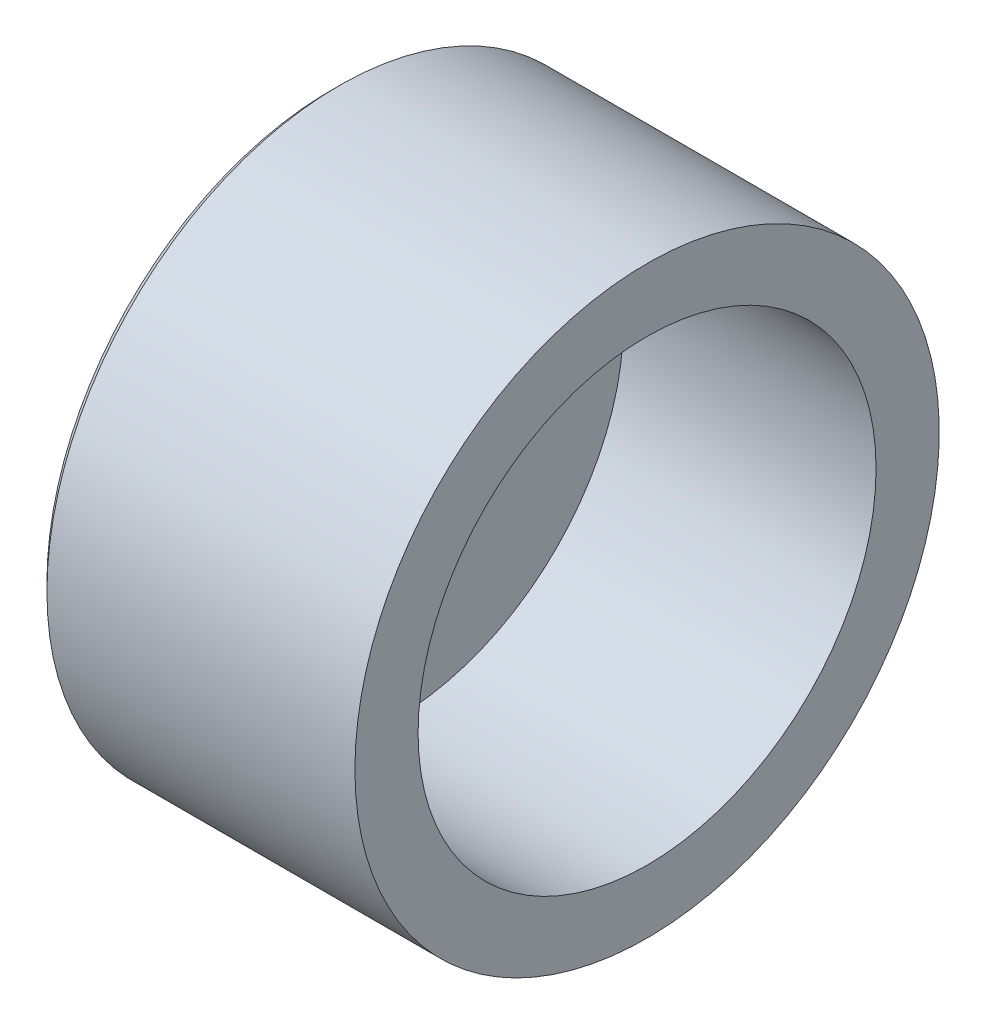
ISO-10303-21;
HEADER;
FILE_DESCRIPTION(('STEP AP214'),'2;1');
FILE_NAME('part.step','',(''),(''),'','','');
FILE_SCHEMA(('AUTOMOTIVE_DESIGN { 1 0 10303 214 1 1 1 1 }'));
ENDSEC;
DATA;
#1=APPLICATION_CONTEXT('core data for automotive mechanical design processes');
#2=APPLICATION_PROTOCOL_DEFINITION('international standard','automotive_design',2000,#1);
#3=PRODUCT_CONTEXT('',#1,'mechanical');
#4=PRODUCT('Part','Part','',(#3));
#5=PRODUCT_RELATED_PRODUCT_CATEGORY('part','',(#4));
#6=PRODUCT_DEFINITION_FORMATION('','',#4);
#7=PRODUCT_DEFINITION_CONTEXT('part definition',#1,'design');
#8=PRODUCT_DEFINITION('design','',#6,#7);
#9=PRODUCT_DEFINITION_SHAPE('','',#8);
#10=(LENGTH_UNIT() NAMED_UNIT(*) SI_UNIT(.MILLI.,.METRE.));
#11=(NAMED_UNIT(*) PLANE_ANGLE_UNIT() SI_UNIT($,.RADIAN.));
#12=(NAMED_UNIT(*) SI_UNIT($,.STERADIAN.) SOLID_ANGLE_UNIT());
#13=UNCERTAINTY_MEASURE_WITH_UNIT(LENGTH_MEASURE(1.E-05),#10,'distance_accuracy_value','');
#14=(GEOMETRIC_REPRESENTATION_CONTEXT(3) GLOBAL_UNCERTAINTY_ASSIGNED_CONTEXT((#13)) GLOBAL_UNIT_ASSIGNED_CONTEXT((#10,
#11,#12)) REPRESENTATION_CONTEXT('',''));
#15=CARTESIAN_POINT('',(0.,0.,0.));
#16=DIRECTION('',(0.,0.,1.));
#17=DIRECTION('',(1.,0.,0.));
#18=AXIS2_PLACEMENT_3D('',#15,#16,#17);
#19=CARTESIAN_POINT('',(2.22044604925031E-13,0.,-8.88178419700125E-13));
#20=DIRECTION('',(-0.999999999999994,0.,0.));
#21=DIRECTION('',(0.,0.,1.));
#22=AXIS2_PLACEMENT_3D('',#19,#20,#21);
#23=CYLINDRICAL_SURFACE('',#22,5.25);
#24=CARTESIAN_POINT('',(3.99999999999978,0.,-6.66133814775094E-13));
#25=DIRECTION('',(-0.999999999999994,0.,0.));
#26=DIRECTION('',(0.,0.,1.));
#27=AXIS2_PLACEMENT_3D('',#24,#25,#26);
#28=CIRCLE('',#27,5.25);
#29=CARTESIAN_POINT('',(3.99999999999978,0.,5.24999999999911));
#30=VERTEX_POINT('',#29);
#31=EDGE_CURVE('E10',#30,#30,#28,.T.);
#32=CARTESIAN_POINT('',(2.22044604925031E-13,0.,-8.88178419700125E-13));
#33=DIRECTION('',(-0.999999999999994,0.,0.));
#34=DIRECTION('',(0.,0.,1.));
#35=AXIS2_PLACEMENT_3D('',#32,#33,#34);
#36=CIRCLE('',#35,5.25);
#37=CARTESIAN_POINT('',(2.24667506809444E-13,0.,5.24999999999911));
#38=VERTEX_POINT('',#37);
#39=EDGE_CURVE('E59',#38,#38,#36,.T.);
#40=CARTESIAN_POINT('',(3.99999999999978,0.,5.24999999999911));
#41=CARTESIAN_POINT('',(3.95833333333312,0.,5.24999999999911));
#42=CARTESIAN_POINT('',(3.91666666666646,0.,5.24999999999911));
#43=CARTESIAN_POINT('',(3.83333333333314,0.,5.24999999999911));
#44=CARTESIAN_POINT('',(3.79166666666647,0.,5.24999999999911));
#45=CARTESIAN_POINT('',(3.70833333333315,0.,5.24999999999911));
#46=CARTESIAN_POINT('',(3.66666666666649,0.,5.24999999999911));
#47=CARTESIAN_POINT('',(3.58333333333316,0.,5.24999999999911));
#48=CARTESIAN_POINT('',(3.5416666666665,0.,5.24999999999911));
#49=CARTESIAN_POINT('',(3.45833333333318,0.,5.24999999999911));
#50=CARTESIAN_POINT('',(3.41666666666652,0.,5.24999999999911));
#51=CARTESIAN_POINT('',(3.33333333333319,0.,5.24999999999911));
#52=CARTESIAN_POINT('',(3.29166666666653,0.,5.24999999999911));
#53=CARTESIAN_POINT('',(3.20833333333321,0.,5.24999999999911));
#54=CARTESIAN_POINT('',(3.16666666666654,0.,5.24999999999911));
#55=CARTESIAN_POINT('',(3.08333333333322,0.,5.24999999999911));
#56=CARTESIAN_POINT('',(3.04166666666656,0.,5.24999999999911));
#57=CARTESIAN_POINT('',(2.95833333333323,0.,5.24999999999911));
#58=CARTESIAN_POINT('',(2.91666666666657,0.,5.24999999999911));
#59=CARTESIAN_POINT('',(2.83333333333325,0.,5.24999999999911));
#60=CARTESIAN_POINT('',(2.79166666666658,0.,5.24999999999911));
#61=CARTESIAN_POINT('',(2.70833333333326,0.,5.24999999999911));
#62=CARTESIAN_POINT('',(2.6666666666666,0.,5.24999999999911));
#63=CARTESIAN_POINT('',(2.58333333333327,0.,5.24999999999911));
#64=CARTESIAN_POINT('',(2.54166666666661,0.,5.24999999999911));
#65=CARTESIAN_POINT('',(2.45833333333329,0.,5.24999999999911));
#66=CARTESIAN_POINT('',(2.41666666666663,0.,5.24999999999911));
#67=CARTESIAN_POINT('',(2.3333333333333,0.,5.24999999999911));
#68=CARTESIAN_POINT('',(2.29166666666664,0.,5.24999999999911));
#69=CARTESIAN_POINT('',(2.20833333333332,0.,5.24999999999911));
#70=CARTESIAN_POINT('',(2.16666666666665,0.,5.24999999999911));
#71=CARTESIAN_POINT('',(2.08333333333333,0.,5.24999999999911));
#72=CARTESIAN_POINT('',(2.04166666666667,0.,5.24999999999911));
#73=CARTESIAN_POINT('',(1.95833333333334,0.,5.24999999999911));
#74=CARTESIAN_POINT('',(1.91666666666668,0.,5.24999999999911));
#75=CARTESIAN_POINT('',(1.83333333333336,0.,5.24999999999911));
#76=CARTESIAN_POINT('',(1.79166666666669,0.,5.24999999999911));
#77=CARTESIAN_POINT('',(1.70833333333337,0.,5.24999999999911));
#78=CARTESIAN_POINT('',(1.66666666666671,0.,5.24999999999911));
#79=CARTESIAN_POINT('',(1.58333333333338,0.,5.24999999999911));
#80=CARTESIAN_POINT('',(1.54166666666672,0.,5.24999999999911));
#81=CARTESIAN_POINT('',(1.4583333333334,0.,5.24999999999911));
#82=CARTESIAN_POINT('',(1.41666666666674,0.,5.24999999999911));
#83=CARTESIAN_POINT('',(1.33333333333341,0.,5.24999999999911));
#84=CARTESIAN_POINT('',(1.29166666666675,0.,5.24999999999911));
#85=CARTESIAN_POINT('',(1.20833333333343,0.,5.24999999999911));
#86=CARTESIAN_POINT('',(1.16666666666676,0.,5.24999999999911));
#87=CARTESIAN_POINT('',(1.08333333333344,0.,5.24999999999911));
#88=CARTESIAN_POINT('',(1.04166666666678,0.,5.24999999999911));
#89=CARTESIAN_POINT('',(0.958333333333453,0.,5.24999999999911));
#90=CARTESIAN_POINT('',(0.916666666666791,0.,5.24999999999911));
#91=CARTESIAN_POINT('',(0.833333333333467,0.,5.24999999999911));
#92=CARTESIAN_POINT('',(0.791666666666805,0.,5.24999999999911));
#93=CARTESIAN_POINT('',(0.70833333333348,0.,5.24999999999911));
#94=CARTESIAN_POINT('',(0.666666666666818,0.,5.24999999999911));
#95=CARTESIAN_POINT('',(0.583333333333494,0.,5.24999999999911));
#96=CARTESIAN_POINT('',(0.541666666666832,0.,5.24999999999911));
#97=CARTESIAN_POINT('',(0.458333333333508,0.,5.24999999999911));
#98=CARTESIAN_POINT('',(0.416666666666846,0.,5.24999999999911));
#99=CARTESIAN_POINT('',(0.333333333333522,0.,5.24999999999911));
#100=CARTESIAN_POINT('',(0.29166666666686,0.,5.24999999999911));
#101=CARTESIAN_POINT('',(0.208333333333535,0.,5.24999999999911));
#102=CARTESIAN_POINT('',(0.166666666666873,0.,5.24999999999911));
#103=CARTESIAN_POINT('',(0.0833333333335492,0.,5.24999999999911));
#104=CARTESIAN_POINT('',(0.041666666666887,0.,5.24999999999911));
#105=CARTESIAN_POINT('',(2.24952001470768E-13,0.,5.24999999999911));
#106=B_SPLINE_CURVE_WITH_KNOTS('',3,(#40,#41,#42,#43,#44,#45,#46,#47,#48,#49,#50,#51,#52,#53,
#54,#55,#56,#57,#58,#59,#60,#61,#62,#63,#64,#65,#66,#67,#68,#69,#70,#71,#72,#73,#74,#75,#76,#77,
#78,#79,#80,#81,#82,#83,#84,#85,#86,#87,#88,#89,#90,#91,#92,#93,#94,#95,#96,#97,#98,#99,#100,
#101,#102,#103,#104,#105),.UNSPECIFIED.,.F.,.F.,(4,2,2,2,2,2,2,2,2,2,2,2,2,2,2,2,2,2,2,2,2,2,2,
2,2,2,2,2,2,2,2,2,4),(0.,0.124999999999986,0.249999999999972,0.374999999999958,
0.499999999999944,0.62499999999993,0.749999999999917,0.874999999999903,0.999999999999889,
1.12499999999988,1.24999999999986,1.37499999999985,1.49999999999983,1.62499999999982,
1.74999999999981,1.87499999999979,1.99999999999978,2.12499999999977,2.24999999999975,
2.37499999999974,2.49999999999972,2.62499999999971,2.7499999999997,2.87499999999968,
2.99999999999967,3.12499999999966,3.24999999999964,3.37499999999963,3.49999999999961,
3.6249999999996,3.74999999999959,3.87499999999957,3.99999999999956),.UNSPECIFIED.);
#107=EDGE_CURVE('BSEAM30',#30,#38,#106,.T.);
#108=ORIENTED_EDGE('',*,*,#31,.F.);
#109=ORIENTED_EDGE('',*,*,#39,.T.);
#110=ORIENTED_EDGE('',*,*,#107,.T.);
#111=ORIENTED_EDGE('',*,*,#107,.F.);
#112=EDGE_LOOP('',(#108,#110,#109,#111));
#113=FACE_BOUND('',#112,.T.);
#114=ADVANCED_FACE('F30',(#113),#23,.F.);
#115=CARTESIAN_POINT('',(3.99999999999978,14.5000000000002,-1.33226762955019E-12));
#116=DIRECTION('',(-0.999999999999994,0.,0.));
#117=DIRECTION('',(0.,0.,1.));
#118=AXIS2_PLACEMENT_3D('',#115,#116,#117);
#119=PLANE('',#118);
#120=CARTESIAN_POINT('',(3.99999999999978,0.,-6.66133814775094E-13));
#121=DIRECTION('',(-0.999999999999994,0.,0.));
#122=DIRECTION('',(0.,0.,1.));
#123=AXIS2_PLACEMENT_3D('',#120,#121,#122);
#124=CIRCLE('',#123,14.5);
#125=CARTESIAN_POINT('',(3.99999999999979,0.,14.4999999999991));
#126=VERTEX_POINT('',#125);
#127=EDGE_CURVE('E37',#126,#126,#124,.T.);
#128=ORIENTED_EDGE('',*,*,#127,.F.);
#129=EDGE_LOOP('',(#128));
#130=FACE_BOUND('',#129,.T.);
#131=ORIENTED_EDGE('',*,*,#31,.T.);
#132=EDGE_LOOP('',(#131));
#133=FACE_BOUND('',#132,.T.);
#134=ADVANCED_FACE('F90',(#130,#133),#119,.F.);
#135=CARTESIAN_POINT('',(2.22044604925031E-13,0.,-8.88178419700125E-13));
#136=DIRECTION('',(-0.999999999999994,0.,0.));
#137=DIRECTION('',(0.,0.,1.));
#138=AXIS2_PLACEMENT_3D('',#135,#136,#137);
#139=CYLINDRICAL_SURFACE('',#138,14.5);
#140=CARTESIAN_POINT('',(20.,0.,-2.22044604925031E-13));
#141=DIRECTION('',(-0.999999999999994,0.,0.));
#142=DIRECTION('',(0.,0.,1.));
#143=AXIS2_PLACEMENT_3D('',#140,#141,#142);
#144=CIRCLE('',#143,14.5);
#145=CARTESIAN_POINT('',(20.,0.,14.4999999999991));
#146=VERTEX_POINT('',#145);
#147=EDGE_CURVE('E44',#146,#146,#144,.T.);
#148=CARTESIAN_POINT('',(20.,0.,14.4999999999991));
#149=CARTESIAN_POINT('',(19.8333333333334,0.,14.4999999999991));
#150=CARTESIAN_POINT('',(19.6666666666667,0.,14.4999999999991));
#151=CARTESIAN_POINT('',(19.3333333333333,0.,14.4999999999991));
#152=CARTESIAN_POINT('',(19.1666666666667,0.,14.4999999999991));
#153=CARTESIAN_POINT('',(18.8333333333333,0.,14.4999999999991));
#154=CARTESIAN_POINT('',(18.6666666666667,0.,14.4999999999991));
#155=CARTESIAN_POINT('',(18.3333333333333,0.,14.4999999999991));
#156=CARTESIAN_POINT('',(18.1666666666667,0.,14.4999999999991));
#157=CARTESIAN_POINT('',(17.8333333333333,0.,14.4999999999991));
#158=CARTESIAN_POINT('',(17.6666666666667,0.,14.4999999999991));
#159=CARTESIAN_POINT('',(17.3333333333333,0.,14.4999999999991));
#160=CARTESIAN_POINT('',(17.1666666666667,0.,14.4999999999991));
#161=CARTESIAN_POINT('',(16.8333333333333,0.,14.4999999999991));
#162=CARTESIAN_POINT('',(16.6666666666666,0.,14.4999999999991));
#163=CARTESIAN_POINT('',(16.3333333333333,0.,14.4999999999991));
#164=CARTESIAN_POINT('',(16.1666666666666,0.,14.4999999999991));
#165=CARTESIAN_POINT('',(15.8333333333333,0.,14.4999999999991));
#166=CARTESIAN_POINT('',(15.6666666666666,0.,14.4999999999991));
#167=CARTESIAN_POINT('',(15.3333333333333,0.,14.4999999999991));
#168=CARTESIAN_POINT('',(15.1666666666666,0.,14.4999999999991));
#169=CARTESIAN_POINT('',(14.8333333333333,0.,14.4999999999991));
#170=CARTESIAN_POINT('',(14.6666666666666,0.,14.4999999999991));
#171=CARTESIAN_POINT('',(14.3333333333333,0.,14.4999999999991));
#172=CARTESIAN_POINT('',(14.1666666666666,0.,14.4999999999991));
#173=CARTESIAN_POINT('',(13.8333333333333,0.,14.4999999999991));
#174=CARTESIAN_POINT('',(13.6666666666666,0.,14.4999999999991));
#175=CARTESIAN_POINT('',(13.3333333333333,0.,14.4999999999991));
#176=CARTESIAN_POINT('',(13.1666666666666,0.,14.4999999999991));
#177=CARTESIAN_POINT('',(12.8333333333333,0.,14.4999999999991));
#178=CARTESIAN_POINT('',(12.6666666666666,0.,14.4999999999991));
#179=CARTESIAN_POINT('',(12.3333333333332,0.,14.4999999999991));
#180=CARTESIAN_POINT('',(12.1666666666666,0.,14.4999999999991));
#181=CARTESIAN_POINT('',(11.8333333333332,0.,14.4999999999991));
#182=CARTESIAN_POINT('',(11.6666666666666,0.,14.4999999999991));
#183=CARTESIAN_POINT('',(11.3333333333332,0.,14.4999999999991));
#184=CARTESIAN_POINT('',(11.1666666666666,0.,14.4999999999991));
#185=CARTESIAN_POINT('',(10.8333333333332,0.,14.4999999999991));
#186=CARTESIAN_POINT('',(10.6666666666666,0.,14.4999999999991));
#187=CARTESIAN_POINT('',(10.3333333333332,0.,14.4999999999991));
#188=CARTESIAN_POINT('',(10.1666666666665,0.,14.4999999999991));
#189=CARTESIAN_POINT('',(9.83333333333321,0.,14.4999999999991));
#190=CARTESIAN_POINT('',(9.66666666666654,0.,14.4999999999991));
#191=CARTESIAN_POINT('',(9.3333333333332,0.,14.4999999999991));
#192=CARTESIAN_POINT('',(9.16666666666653,0.,14.4999999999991));
#193=CARTESIAN_POINT('',(8.8333333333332,0.,14.4999999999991));
#194=CARTESIAN_POINT('',(8.66666666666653,0.,14.4999999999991));
#195=CARTESIAN_POINT('',(8.33333333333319,0.,14.4999999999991));
#196=CARTESIAN_POINT('',(8.16666666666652,0.,14.4999999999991));
#197=CARTESIAN_POINT('',(7.83333333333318,0.,14.4999999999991));
#198=CARTESIAN_POINT('',(7.66666666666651,0.,14.4999999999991));
#199=CARTESIAN_POINT('',(7.33333333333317,0.,14.4999999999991));
#200=CARTESIAN_POINT('',(7.1666666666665,0.,14.4999999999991));
#201=CARTESIAN_POINT('',(6.83333333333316,0.,14.4999999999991));
#202=CARTESIAN_POINT('',(6.6666666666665,0.,14.4999999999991));
#203=CARTESIAN_POINT('',(6.33333333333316,0.,14.4999999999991));
#204=CARTESIAN_POINT('',(6.16666666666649,0.,14.4999999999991));
#205=CARTESIAN_POINT('',(5.83333333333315,0.,14.4999999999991));
#206=CARTESIAN_POINT('',(5.66666666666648,0.,14.4999999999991));
#207=CARTESIAN_POINT('',(5.33333333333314,0.,14.4999999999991));
#208=CARTESIAN_POINT('',(5.16666666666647,0.,14.4999999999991));
#209=CARTESIAN_POINT('',(4.83333333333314,0.,14.4999999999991));
#210=CARTESIAN_POINT('',(4.66666666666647,0.,14.4999999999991));
#211=CARTESIAN_POINT('',(4.33333333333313,0.,14.4999999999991));
#212=CARTESIAN_POINT('',(4.16666666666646,0.,14.4999999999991));
#213=CARTESIAN_POINT('',(3.99999999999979,0.,14.4999999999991));
#214=B_SPLINE_CURVE_WITH_KNOTS('',3,(#148,#149,#150,#151,#152,#153,#154,#155,#156,#157,#158,
#159,#160,#161,#162,#163,#164,#165,#166,#167,#168,#169,#170,#171,#172,#173,#174,#175,#176,#177,
#178,#179,#180,#181,#182,#183,#184,#185,#186,#187,#188,#189,#190,#191,#192,#193,#194,#195,#196,
#197,#198,#199,#200,#201,#202,#203,#204,#205,#206,#207,#208,#209,#210,#211,#212,#213),
.UNSPECIFIED.,.F.,.F.,(4,2,2,2,2,2,2,2,2,2,2,2,2,2,2,2,2,2,2,2,2,2,2,2,2,2,2,2,2,2,2,2,4),(0.,
0.500000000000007,1.00000000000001,1.50000000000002,2.00000000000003,2.50000000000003,
3.00000000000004,3.50000000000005,4.00000000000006,4.50000000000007,5.00000000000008,
5.50000000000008,6.00000000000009,6.5000000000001,7.0000000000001,7.50000000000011,
8.00000000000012,8.50000000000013,9.00000000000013,9.50000000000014,10.0000000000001,
10.5000000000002,11.0000000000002,11.5000000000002,12.0000000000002,12.5000000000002,
13.0000000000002,13.5000000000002,14.0000000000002,14.5000000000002,15.0000000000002,
15.5000000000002,16.0000000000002),.UNSPECIFIED.);
#215=EDGE_CURVE('BSEAM85',#146,#126,#214,.T.);
#216=ORIENTED_EDGE('',*,*,#147,.F.);
#217=ORIENTED_EDGE('',*,*,#127,.T.);
#218=ORIENTED_EDGE('',*,*,#215,.T.);
#219=ORIENTED_EDGE('',*,*,#215,.F.);
#220=EDGE_LOOP('',(#216,#218,#217,#219));
#221=FACE_BOUND('',#220,.T.);
#222=ADVANCED_FACE('F85',(#221),#139,.F.);
#223=CARTESIAN_POINT('',(19.9999999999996,18.5,-6.66133814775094E-13));
#224=DIRECTION('',(-0.999999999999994,0.,0.));
#225=DIRECTION('',(0.,0.,1.));
#226=AXIS2_PLACEMENT_3D('',#223,#224,#225);
#227=PLANE('',#226);
#228=CARTESIAN_POINT('',(20.,0.,-2.22044604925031E-13));
#229=DIRECTION('',(-0.999999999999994,0.,0.));
#230=DIRECTION('',(0.,0.,1.));
#231=AXIS2_PLACEMENT_3D('',#228,#229,#230);
#232=CIRCLE('',#231,18.5);
#233=CARTESIAN_POINT('',(20.,0.,18.4999999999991));
#234=VERTEX_POINT('',#233);
#235=EDGE_CURVE('E48',#234,#234,#232,.T.);
#236=ORIENTED_EDGE('',*,*,#235,.F.);
#237=EDGE_LOOP('',(#236));
#238=FACE_BOUND('',#237,.T.);
#239=ORIENTED_EDGE('',*,*,#147,.T.);
#240=EDGE_LOOP('',(#239));
#241=FACE_BOUND('',#240,.T.);
#242=ADVANCED_FACE('F79',(#238,#241),#227,.F.);
#243=CARTESIAN_POINT('',(2.22044604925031E-13,0.,-8.88178419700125E-13));
#244=DIRECTION('',(-0.999999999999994,0.,0.));
#245=DIRECTION('',(0.,0.,1.));
#246=AXIS2_PLACEMENT_3D('',#243,#244,#245);
#247=CYLINDRICAL_SURFACE('',#246,18.5);
#248=CARTESIAN_POINT('',(0.499999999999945,-4.44089209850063E-13,-8.88178419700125E-13));
#249=DIRECTION('',(-0.999999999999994,0.,0.));
#250=DIRECTION('',(0.,0.,1.));
#251=AXIS2_PLACEMENT_3D('',#248,#249,#250);
#252=CIRCLE('',#251,18.5);
#253=CARTESIAN_POINT('',(0.499999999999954,0.,18.4999999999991));
#254=VERTEX_POINT('',#253);
#255=EDGE_CURVE('E53',#254,#254,#252,.T.);
#256=CARTESIAN_POINT('',(0.499999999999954,0.,18.4999999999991));
#257=CARTESIAN_POINT('',(0.703124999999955,0.,18.4999999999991));
#258=CARTESIAN_POINT('',(0.906249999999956,0.,18.4999999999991));
#259=CARTESIAN_POINT('',(1.31249999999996,0.,18.4999999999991));
#260=CARTESIAN_POINT('',(1.51562499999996,0.,18.4999999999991));
#261=CARTESIAN_POINT('',(1.92187499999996,0.,18.4999999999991));
#262=CARTESIAN_POINT('',(2.12499999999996,0.,18.4999999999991));
#263=CARTESIAN_POINT('',(2.53124999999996,0.,18.4999999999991));
#264=CARTESIAN_POINT('',(2.73437499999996,0.,18.4999999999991));
#265=CARTESIAN_POINT('',(3.14062499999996,0.,18.4999999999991));
#266=CARTESIAN_POINT('',(3.34374999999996,0.,18.4999999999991));
#267=CARTESIAN_POINT('',(3.74999999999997,0.,18.4999999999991));
#268=CARTESIAN_POINT('',(3.95312499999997,0.,18.4999999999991));
#269=CARTESIAN_POINT('',(4.35937499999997,0.,18.4999999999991));
#270=CARTESIAN_POINT('',(4.56249999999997,0.,18.4999999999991));
#271=CARTESIAN_POINT('',(4.96874999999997,0.,18.4999999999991));
#272=CARTESIAN_POINT('',(5.17187499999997,0.,18.4999999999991));
#273=CARTESIAN_POINT('',(5.57812499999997,0.,18.4999999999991));
#274=CARTESIAN_POINT('',(5.78124999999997,0.,18.4999999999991));
#275=CARTESIAN_POINT('',(6.18749999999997,0.,18.4999999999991));
#276=CARTESIAN_POINT('',(6.39062499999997,0.,18.4999999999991));
#277=CARTESIAN_POINT('',(6.79687499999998,0.,18.4999999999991));
#278=CARTESIAN_POINT('',(6.99999999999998,0.,18.4999999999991));
#279=CARTESIAN_POINT('',(7.40624999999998,0.,18.4999999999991));
#280=CARTESIAN_POINT('',(7.60937499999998,0.,18.4999999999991));
#281=CARTESIAN_POINT('',(8.01562499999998,0.,18.4999999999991));
#282=CARTESIAN_POINT('',(8.21874999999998,0.,18.4999999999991));
#283=CARTESIAN_POINT('',(8.62499999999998,0.,18.4999999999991));
#284=CARTESIAN_POINT('',(8.82812499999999,0.,18.4999999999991));
#285=CARTESIAN_POINT('',(9.23437499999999,0.,18.4999999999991));
#286=CARTESIAN_POINT('',(9.43749999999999,0.,18.4999999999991));
#287=CARTESIAN_POINT('',(9.84374999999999,0.,18.4999999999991));
#288=CARTESIAN_POINT('',(10.046875,0.,18.4999999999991));
#289=CARTESIAN_POINT('',(10.453125,0.,18.4999999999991));
#290=CARTESIAN_POINT('',(10.65625,0.,18.4999999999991));
#291=CARTESIAN_POINT('',(11.0625,0.,18.4999999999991));
#292=CARTESIAN_POINT('',(11.265625,0.,18.4999999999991));
#293=CARTESIAN_POINT('',(11.671875,0.,18.4999999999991));
#294=CARTESIAN_POINT('',(11.875,0.,18.4999999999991));
#295=CARTESIAN_POINT('',(12.28125,0.,18.4999999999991));
#296=CARTESIAN_POINT('',(12.484375,0.,18.4999999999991));
#297=CARTESIAN_POINT('',(12.890625,0.,18.4999999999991));
#298=CARTESIAN_POINT('',(13.09375,0.,18.4999999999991));
#299=CARTESIAN_POINT('',(13.5,0.,18.4999999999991));
#300=CARTESIAN_POINT('',(13.703125,0.,18.4999999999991));
#301=CARTESIAN_POINT('',(14.109375,0.,18.4999999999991));
#302=CARTESIAN_POINT('',(14.3125,0.,18.4999999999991));
#303=CARTESIAN_POINT('',(14.71875,0.,18.4999999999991));
#304=CARTESIAN_POINT('',(14.921875,0.,18.4999999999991));
#305=CARTESIAN_POINT('',(15.328125,0.,18.4999999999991));
#306=CARTESIAN_POINT('',(15.53125,0.,18.4999999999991));
#307=CARTESIAN_POINT('',(15.9375,0.,18.4999999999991));
#308=CARTESIAN_POINT('',(16.140625,0.,18.4999999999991));
#309=CARTESIAN_POINT('',(16.546875,0.,18.4999999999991));
#310=CARTESIAN_POINT('',(16.75,0.,18.4999999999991));
#311=CARTESIAN_POINT('',(17.15625,0.,18.4999999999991));
#312=CARTESIAN_POINT('',(17.359375,0.,18.4999999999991));
#313=CARTESIAN_POINT('',(17.765625,0.,18.4999999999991));
#314=CARTESIAN_POINT('',(17.96875,0.,18.4999999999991));
#315=CARTESIAN_POINT('',(18.375,0.,18.4999999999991));
#316=CARTESIAN_POINT('',(18.578125,0.,18.4999999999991));
#317=CARTESIAN_POINT('',(18.984375,0.,18.4999999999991));
#318=CARTESIAN_POINT('',(19.1875,0.,18.4999999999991));
#319=CARTESIAN_POINT('',(19.59375,0.,18.4999999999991));
#320=CARTESIAN_POINT('',(19.796875,0.,18.4999999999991));
#321=CARTESIAN_POINT('',(20.,0.,18.4999999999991));
#322=B_SPLINE_CURVE_WITH_KNOTS('',3,(#256,#257,#258,#259,#260,#261,#262,#263,#264,#265,#266,
#267,#268,#269,#270,#271,#272,#273,#274,#275,#276,#277,#278,#279,#280,#281,#282,#283,#284,#285,
#286,#287,#288,#289,#290,#291,#292,#293,#294,#295,#296,#297,#298,#299,#300,#301,#302,#303,#304,
#305,#306,#307,#308,#309,#310,#311,#312,#313,#314,#315,#316,#317,#318,#319,#320,#321),
.UNSPECIFIED.,.F.,.F.,(4,2,2,2,2,2,2,2,2,2,2,2,2,2,2,2,2,2,2,2,2,2,2,2,2,2,2,2,2,2,2,2,4),(0.,
0.609375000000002,1.21875,1.82812500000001,2.43750000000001,3.04687500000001,3.65625000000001,
4.26562500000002,4.87500000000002,5.48437500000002,6.09375000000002,6.70312500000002,
7.31250000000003,7.92187500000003,8.53125000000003,9.14062500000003,9.75000000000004,10.359375,
10.96875,11.578125,12.1875,12.796875,13.40625,14.015625,14.6250000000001,15.2343750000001,
15.8437500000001,16.4531250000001,17.0625000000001,17.6718750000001,18.2812500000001,
18.8906250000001,19.5000000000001),.UNSPECIFIED.);
#323=EDGE_CURVE('BSEAM73',#254,#234,#322,.T.);
#324=ORIENTED_EDGE('',*,*,#255,.F.);
#325=ORIENTED_EDGE('',*,*,#235,.T.);
#326=ORIENTED_EDGE('',*,*,#323,.T.);
#327=ORIENTED_EDGE('',*,*,#323,.F.);
#328=EDGE_LOOP('',(#324,#326,#325,#327));
#329=FACE_BOUND('',#328,.T.);
#330=ADVANCED_FACE('F73',(#329),#247,.T.);
#331=CARTESIAN_POINT('',(0.499999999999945,-4.44089209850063E-13,-8.88178419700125E-13));
#332=DIRECTION('',(0.999999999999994,0.,0.));
#333=DIRECTION('',(0.,0.,-1.));
#334=AXIS2_PLACEMENT_3D('',#331,#332,#333);
#335=CONICAL_SURFACE('',#334,18.5,0.785398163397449);
#336=CARTESIAN_POINT('',(2.22044604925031E-13,0.,-8.88178419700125E-13));
#337=DIRECTION('',(-0.999999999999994,0.,0.));
#338=DIRECTION('',(0.,0.,1.));
#339=AXIS2_PLACEMENT_3D('',#336,#337,#338);
#340=CIRCLE('',#339,18.);
#341=CARTESIAN_POINT('',(2.2903900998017E-13,0.,17.9999999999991));
#342=VERTEX_POINT('',#341);
#343=EDGE_CURVE('E56',#342,#342,#340,.T.);
#344=ORIENTED_EDGE('',*,*,#343,.F.);
#345=EDGE_LOOP('',(#344));
#346=FACE_BOUND('',#345,.T.);
#347=ORIENTED_EDGE('',*,*,#255,.T.);
#348=EDGE_LOOP('',(#347));
#349=FACE_BOUND('',#348,.T.);
#350=ADVANCED_FACE('F67',(#346,#349),#335,.T.);
#351=CARTESIAN_POINT('',(2.22044604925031E-13,5.2500000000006,0.));
#352=DIRECTION('',(0.999999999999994,0.,0.));
#353=DIRECTION('',(0.,0.,-1.));
#354=AXIS2_PLACEMENT_3D('',#351,#352,#353);
#355=PLANE('',#354);
#356=ORIENTED_EDGE('',*,*,#39,.F.);
#357=EDGE_LOOP('',(#356));
#358=FACE_BOUND('',#357,.T.);
#359=ORIENTED_EDGE('',*,*,#343,.T.);
#360=EDGE_LOOP('',(#359));
#361=FACE_BOUND('',#360,.T.);
#362=ADVANCED_FACE('F64',(#358,#361),#355,.F.);
#363=CLOSED_SHELL('',(#114,#134,#222,#242,#330,#350,#362));
#364=MANIFOLD_SOLID_BREP('B2',#363);
#365=ADVANCED_BREP_SHAPE_REPRESENTATION('',(#18,#364),#14);
#366=SHAPE_DEFINITION_REPRESENTATION(#9,#365);
ENDSEC;
END-ISO-10303-21;
